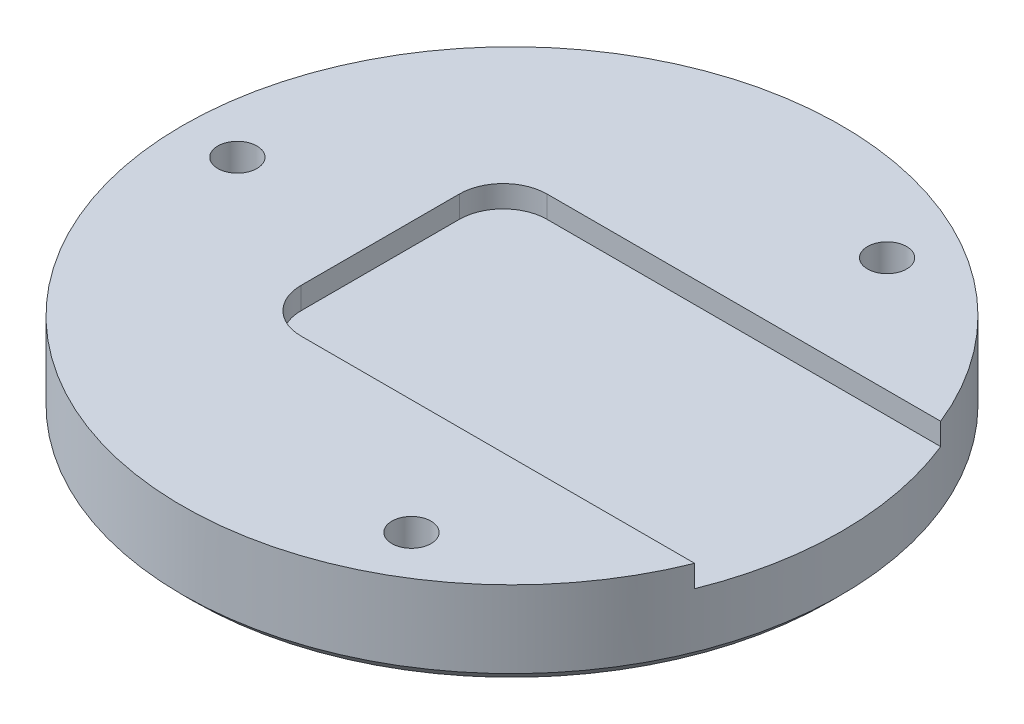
ISO-10303-21;
HEADER;
FILE_DESCRIPTION(('STEP AP214'),'2;1');
FILE_NAME('part.step','',(''),(''),'','','');
FILE_SCHEMA(('AUTOMOTIVE_DESIGN { 1 0 10303 214 1 1 1 1 }'));
ENDSEC;
DATA;
#1=APPLICATION_CONTEXT('core data for automotive mechanical design processes');
#2=APPLICATION_PROTOCOL_DEFINITION('international standard','automotive_design',2000,#1);
#3=PRODUCT_CONTEXT('',#1,'mechanical');
#4=PRODUCT('Part','Part','',(#3));
#5=PRODUCT_RELATED_PRODUCT_CATEGORY('part','',(#4));
#6=PRODUCT_DEFINITION_FORMATION('','',#4);
#7=PRODUCT_DEFINITION_CONTEXT('part definition',#1,'design');
#8=PRODUCT_DEFINITION('design','',#6,#7);
#9=PRODUCT_DEFINITION_SHAPE('','',#8);
#10=(LENGTH_UNIT() NAMED_UNIT(*) SI_UNIT(.MILLI.,.METRE.));
#11=(NAMED_UNIT(*) PLANE_ANGLE_UNIT() SI_UNIT($,.RADIAN.));
#12=(NAMED_UNIT(*) SI_UNIT($,.STERADIAN.) SOLID_ANGLE_UNIT());
#13=UNCERTAINTY_MEASURE_WITH_UNIT(LENGTH_MEASURE(1.E-05),#10,'distance_accuracy_value','');
#14=(GEOMETRIC_REPRESENTATION_CONTEXT(3) GLOBAL_UNCERTAINTY_ASSIGNED_CONTEXT((#13)) GLOBAL_UNIT_ASSIGNED_CONTEXT((#10,
#11,#12)) REPRESENTATION_CONTEXT('',''));
#15=CARTESIAN_POINT('',(0.,0.,0.));
#16=DIRECTION('',(0.,0.,1.));
#17=DIRECTION('',(1.,0.,0.));
#18=AXIS2_PLACEMENT_3D('',#15,#16,#17);
#19=CARTESIAN_POINT('',(48.1759321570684,-79.2351408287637,64.1677762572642));
#20=DIRECTION('',(0.,-1.,0.));
#21=DIRECTION('',(0.,0.,-1.));
#22=AXIS2_PLACEMENT_3D('',#19,#20,#21);
#23=CYLINDRICAL_SURFACE('',#22,19.05);
#24=CARTESIAN_POINT('',(48.1759321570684,-83.6801408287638,64.1677762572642));
#25=DIRECTION('',(0.,1.,0.));
#26=DIRECTION('',(0.,0.,1.));
#27=AXIS2_PLACEMENT_3D('',#24,#25,#26);
#28=CIRCLE('',#27,19.05);
#29=CARTESIAN_POINT('',(48.1759321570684,-83.6801408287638,83.2177762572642));
#30=VERTEX_POINT('',#29);
#31=EDGE_CURVE('E52',#30,#30,#28,.T.);
#32=ORIENTED_EDGE('',*,*,#31,.T.);
#33=EDGE_LOOP('',(#32));
#34=FACE_BOUND('',#33,.T.);
#35=CARTESIAN_POINT('',(48.1759321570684,-79.2351408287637,64.1677762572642));
#36=DIRECTION('',(0.,1.,0.));
#37=DIRECTION('',(0.,0.,1.));
#38=AXIS2_PLACEMENT_3D('',#35,#36,#37);
#39=CIRCLE('',#38,19.05);
#40=CARTESIAN_POINT('',(65.8485651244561,-79.2351408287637,57.0557762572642));
#41=VERTEX_POINT('',#40);
#42=CARTESIAN_POINT('',(65.8485651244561,-79.2351408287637,71.2797762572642));
#43=VERTEX_POINT('',#42);
#44=EDGE_CURVE('E124',#41,#43,#39,.T.);
#45=ORIENTED_EDGE('',*,*,#44,.F.);
#46=DIRECTION('',(0.,1.,0.));
#47=VECTOR('',#46,1.);
#48=CARTESIAN_POINT('',(65.8485651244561,-80.5051408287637,57.0557762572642));
#49=LINE('',#48,#47);
#50=CARTESIAN_POINT('',(65.8485651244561,-80.5051408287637,57.0557762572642));
#51=VERTEX_POINT('',#50);
#52=EDGE_CURVE('E104',#51,#41,#49,.T.);
#53=ORIENTED_EDGE('',*,*,#52,.F.);
#54=CARTESIAN_POINT('',(48.1759321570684,-80.5051408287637,64.1677762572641));
#55=DIRECTION('',(0.,1.,0.));
#56=DIRECTION('',(0.,0.,1.));
#57=AXIS2_PLACEMENT_3D('',#54,#55,#56);
#58=CIRCLE('',#57,19.05);
#59=CARTESIAN_POINT('',(65.8485651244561,-80.5051408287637,71.2797762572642));
#60=VERTEX_POINT('',#59);
#61=EDGE_CURVE('E110',#60,#51,#58,.T.);
#62=ORIENTED_EDGE('',*,*,#61,.F.);
#63=DIRECTION('',(0.,1.,0.));
#64=VECTOR('',#63,1.);
#65=CARTESIAN_POINT('',(65.8485651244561,-80.5051408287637,71.2797762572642));
#66=LINE('',#65,#64);
#67=EDGE_CURVE('E125',#60,#43,#66,.T.);
#68=ORIENTED_EDGE('',*,*,#67,.T.);
#69=EDGE_LOOP('',(#45,#53,#62,#68));
#70=FACE_BOUND('',#69,.T.);
#71=ADVANCED_FACE('F43',(#34,#70),#23,.T.);
#72=CARTESIAN_POINT('',(48.1759321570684,-79.2351408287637,64.1677762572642));
#73=DIRECTION('',(0.,1.,0.));
#74=DIRECTION('',(0.,0.,1.));
#75=AXIS2_PLACEMENT_3D('',#72,#73,#74);
#76=PLANE('',#75);
#77=CARTESIAN_POINT('',(56.1134321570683,-79.2351408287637,50.4196229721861));
#78=DIRECTION('',(0.,1.,0.));
#79=DIRECTION('',(0.,0.,1.));
#80=AXIS2_PLACEMENT_3D('',#77,#78,#79);
#81=CIRCLE('',#80,1.1303);
#82=CARTESIAN_POINT('',(56.1134321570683,-79.2351408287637,51.5499229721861));
#83=VERTEX_POINT('',#82);
#84=EDGE_CURVE('E199',#83,#83,#81,.T.);
#85=ORIENTED_EDGE('',*,*,#84,.F.);
#86=EDGE_LOOP('',(#85));
#87=FACE_BOUND('',#86,.T.);
#88=CARTESIAN_POINT('',(56.1134321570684,-79.2351408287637,77.9159295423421));
#89=DIRECTION('',(0.,1.,0.));
#90=DIRECTION('',(0.,0.,1.));
#91=AXIS2_PLACEMENT_3D('',#88,#89,#90);
#92=CIRCLE('',#91,1.1303);
#93=CARTESIAN_POINT('',(56.1134321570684,-79.2351408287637,79.0462295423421));
#94=VERTEX_POINT('',#93);
#95=EDGE_CURVE('E192',#94,#94,#92,.T.);
#96=ORIENTED_EDGE('',*,*,#95,.F.);
#97=EDGE_LOOP('',(#96));
#98=FACE_BOUND('',#97,.T.);
#99=CARTESIAN_POINT('',(32.3009321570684,-79.2351408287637,64.1677762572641));
#100=DIRECTION('',(0.,1.,0.));
#101=DIRECTION('',(0.,0.,1.));
#102=AXIS2_PLACEMENT_3D('',#99,#100,#101);
#103=CIRCLE('',#102,1.1303);
#104=CARTESIAN_POINT('',(32.3009321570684,-79.2351408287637,65.2980762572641));
#105=VERTEX_POINT('',#104);
#106=EDGE_CURVE('E196',#105,#105,#103,.T.);
#107=ORIENTED_EDGE('',*,*,#106,.F.);
#108=EDGE_LOOP('',(#107));
#109=FACE_BOUND('',#108,.T.);
#110=DIRECTION('',(-1.,0.,0.));
#111=VECTOR('',#110,1.);
#112=CARTESIAN_POINT('',(48.1759321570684,-79.2351408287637,57.0557762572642));
#113=LINE('',#112,#111);
#114=CARTESIAN_POINT('',(43.0959321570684,-79.2351408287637,57.0557762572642));
#115=VERTEX_POINT('',#114);
#116=EDGE_CURVE('E221',#41,#115,#113,.T.);
#117=ORIENTED_EDGE('',*,*,#116,.F.);
#118=ORIENTED_EDGE('',*,*,#44,.T.);
#119=DIRECTION('',(1.,0.,0.));
#120=VECTOR('',#119,1.);
#121=CARTESIAN_POINT('',(48.1759321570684,-79.2351408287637,71.2797762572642));
#122=LINE('',#121,#120);
#123=CARTESIAN_POINT('',(43.0959321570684,-79.2351408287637,71.2797762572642));
#124=VERTEX_POINT('',#123);
#125=EDGE_CURVE('E219',#124,#43,#122,.T.);
#126=ORIENTED_EDGE('',*,*,#125,.F.);
#127=CARTESIAN_POINT('',(43.0959321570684,-79.2351408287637,68.7397762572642));
#128=DIRECTION('',(0.,1.,0.));
#129=DIRECTION('',(0.,0.,1.));
#130=AXIS2_PLACEMENT_3D('',#127,#128,#129);
#131=CIRCLE('',#130,2.54);
#132=CARTESIAN_POINT('',(40.5559321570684,-79.2351408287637,68.7397762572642));
#133=VERTEX_POINT('',#132);
#134=EDGE_CURVE('E216',#133,#124,#131,.T.);
#135=ORIENTED_EDGE('',*,*,#134,.F.);
#136=DIRECTION('',(0.,0.,1.));
#137=VECTOR('',#136,1.);
#138=CARTESIAN_POINT('',(40.5559321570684,-79.2351408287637,64.1677762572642));
#139=LINE('',#138,#137);
#140=CARTESIAN_POINT('',(40.5559321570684,-79.2351408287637,59.5957762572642));
#141=VERTEX_POINT('',#140);
#142=EDGE_CURVE('E59',#141,#133,#139,.T.);
#143=ORIENTED_EDGE('',*,*,#142,.F.);
#144=CARTESIAN_POINT('',(43.0959321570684,-79.2351408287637,59.5957762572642));
#145=DIRECTION('',(0.,1.,0.));
#146=DIRECTION('',(0.,0.,1.));
#147=AXIS2_PLACEMENT_3D('',#144,#145,#146);
#148=CIRCLE('',#147,2.54);
#149=EDGE_CURVE('E211',#115,#141,#148,.T.);
#150=ORIENTED_EDGE('',*,*,#149,.F.);
#151=EDGE_LOOP('',(#117,#118,#126,#135,#143,#150));
#152=FACE_BOUND('',#151,.T.);
#153=ADVANCED_FACE('F149',(#87,#98,#109,#152),#76,.T.);
#154=CARTESIAN_POINT('',(48.1759321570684,-84.3151408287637,64.1677762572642));
#155=DIRECTION('',(0.,1.,0.));
#156=DIRECTION('',(0.,0.,1.));
#157=AXIS2_PLACEMENT_3D('',#154,#155,#156);
#158=PLANE('',#157);
#159=CARTESIAN_POINT('',(48.1759321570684,-84.3151408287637,64.1677762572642));
#160=DIRECTION('',(0.,1.,0.));
#161=DIRECTION('',(0.,0.,1.));
#162=AXIS2_PLACEMENT_3D('',#159,#160,#161);
#163=CIRCLE('',#162,18.415);
#164=CARTESIAN_POINT('',(48.1759321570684,-84.3151408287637,82.5827762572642));
#165=VERTEX_POINT('',#164);
#166=EDGE_CURVE('E11',#165,#165,#163,.F.);
#167=ORIENTED_EDGE('',*,*,#166,.T.);
#168=EDGE_LOOP('',(#167));
#169=FACE_BOUND('',#168,.T.);
#170=CARTESIAN_POINT('',(56.1134321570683,-84.3151408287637,50.4196229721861));
#171=DIRECTION('',(0.,1.,0.));
#172=DIRECTION('',(0.,0.,1.));
#173=AXIS2_PLACEMENT_3D('',#170,#171,#172);
#174=CIRCLE('',#173,1.1303);
#175=CARTESIAN_POINT('',(56.1134321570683,-84.3151408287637,51.5499229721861));
#176=VERTEX_POINT('',#175);
#177=EDGE_CURVE('E194',#176,#176,#174,.T.);
#178=ORIENTED_EDGE('',*,*,#177,.T.);
#179=EDGE_LOOP('',(#178));
#180=FACE_BOUND('',#179,.T.);
#181=CARTESIAN_POINT('',(56.1134321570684,-84.3151408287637,77.9159295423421));
#182=DIRECTION('',(0.,1.,0.));
#183=DIRECTION('',(0.,0.,1.));
#184=AXIS2_PLACEMENT_3D('',#181,#182,#183);
#185=CIRCLE('',#184,1.1303);
#186=CARTESIAN_POINT('',(56.1134321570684,-84.3151408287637,79.0462295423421));
#187=VERTEX_POINT('',#186);
#188=EDGE_CURVE('E189',#187,#187,#185,.T.);
#189=ORIENTED_EDGE('',*,*,#188,.T.);
#190=EDGE_LOOP('',(#189));
#191=FACE_BOUND('',#190,.T.);
#192=CARTESIAN_POINT('',(32.3009321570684,-84.3151408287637,64.1677762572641));
#193=DIRECTION('',(0.,1.,0.));
#194=DIRECTION('',(0.,0.,1.));
#195=AXIS2_PLACEMENT_3D('',#192,#193,#194);
#196=CIRCLE('',#195,1.1303);
#197=CARTESIAN_POINT('',(32.3009321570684,-84.3151408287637,65.2980762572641));
#198=VERTEX_POINT('',#197);
#199=EDGE_CURVE('E205',#198,#198,#196,.T.);
#200=ORIENTED_EDGE('',*,*,#199,.T.);
#201=EDGE_LOOP('',(#200));
#202=FACE_BOUND('',#201,.T.);
#203=ADVANCED_FACE('F153',(#169,#180,#191,#202),#158,.F.);
#204=CARTESIAN_POINT('',(40.5559321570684,-80.5051408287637,64.1677762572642));
#205=DIRECTION('',(-1.,0.,0.));
#206=DIRECTION('',(0.,0.,1.));
#207=AXIS2_PLACEMENT_3D('',#204,#205,#206);
#208=PLANE('',#207);
#209=ORIENTED_EDGE('',*,*,#142,.T.);
#210=DIRECTION('',(0.,1.,0.));
#211=VECTOR('',#210,1.);
#212=CARTESIAN_POINT('',(40.5559321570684,-80.5051408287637,68.7397762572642));
#213=LINE('',#212,#211);
#214=CARTESIAN_POINT('',(40.5559321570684,-80.5051408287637,68.7397762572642));
#215=VERTEX_POINT('',#214);
#216=EDGE_CURVE('E89',#215,#133,#213,.T.);
#217=ORIENTED_EDGE('',*,*,#216,.F.);
#218=DIRECTION('',(0.,0.,1.));
#219=VECTOR('',#218,1.);
#220=CARTESIAN_POINT('',(40.5559321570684,-80.5051408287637,64.1677762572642));
#221=LINE('',#220,#219);
#222=CARTESIAN_POINT('',(40.5559321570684,-80.5051408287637,59.5957762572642));
#223=VERTEX_POINT('',#222);
#224=EDGE_CURVE('E208',#223,#215,#221,.T.);
#225=ORIENTED_EDGE('',*,*,#224,.F.);
#226=DIRECTION('',(0.,1.,0.));
#227=VECTOR('',#226,1.);
#228=CARTESIAN_POINT('',(40.5559321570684,-80.5051408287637,59.5957762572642));
#229=LINE('',#228,#227);
#230=EDGE_CURVE('E67',#223,#141,#229,.T.);
#231=ORIENTED_EDGE('',*,*,#230,.T.);
#232=EDGE_LOOP('',(#209,#217,#225,#231));
#233=FACE_BOUND('',#232,.T.);
#234=ADVANCED_FACE('F158',(#233),#208,.F.);
#235=CARTESIAN_POINT('',(43.0959321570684,-80.5051408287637,59.5957762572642));
#236=DIRECTION('',(0.,1.,0.));
#237=DIRECTION('',(0.,0.,1.));
#238=AXIS2_PLACEMENT_3D('',#235,#236,#237);
#239=CYLINDRICAL_SURFACE('',#238,2.54);
#240=ORIENTED_EDGE('',*,*,#149,.T.);
#241=ORIENTED_EDGE('',*,*,#230,.F.);
#242=CARTESIAN_POINT('',(43.0959321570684,-80.5051408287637,59.5957762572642));
#243=DIRECTION('',(0.,1.,0.));
#244=DIRECTION('',(0.,0.,1.));
#245=AXIS2_PLACEMENT_3D('',#242,#243,#244);
#246=CIRCLE('',#245,2.54);
#247=CARTESIAN_POINT('',(43.0959321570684,-80.5051408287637,57.0557762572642));
#248=VERTEX_POINT('',#247);
#249=EDGE_CURVE('E109',#248,#223,#246,.T.);
#250=ORIENTED_EDGE('',*,*,#249,.F.);
#251=DIRECTION('',(0.,1.,0.));
#252=VECTOR('',#251,1.);
#253=CARTESIAN_POINT('',(43.0959321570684,-80.5051408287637,57.0557762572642));
#254=LINE('',#253,#252);
#255=EDGE_CURVE('E106',#248,#115,#254,.T.);
#256=ORIENTED_EDGE('',*,*,#255,.T.);
#257=EDGE_LOOP('',(#240,#241,#250,#256));
#258=FACE_BOUND('',#257,.T.);
#259=ADVANCED_FACE('F163',(#258),#239,.F.);
#260=CARTESIAN_POINT('',(48.1759321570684,-80.5051408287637,57.0557762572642));
#261=DIRECTION('',(0.,0.,-1.));
#262=DIRECTION('',(-1.,0.,0.));
#263=AXIS2_PLACEMENT_3D('',#260,#261,#262);
#264=PLANE('',#263);
#265=ORIENTED_EDGE('',*,*,#116,.T.);
#266=ORIENTED_EDGE('',*,*,#255,.F.);
#267=DIRECTION('',(-1.,0.,0.));
#268=VECTOR('',#267,1.);
#269=CARTESIAN_POINT('',(48.1759321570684,-80.5051408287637,57.0557762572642));
#270=LINE('',#269,#268);
#271=EDGE_CURVE('E99',#51,#248,#270,.T.);
#272=ORIENTED_EDGE('',*,*,#271,.F.);
#273=ORIENTED_EDGE('',*,*,#52,.T.);
#274=EDGE_LOOP('',(#265,#266,#272,#273));
#275=FACE_BOUND('',#274,.T.);
#276=ADVANCED_FACE('F102',(#275),#264,.F.);
#277=CARTESIAN_POINT('',(48.1759321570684,-80.5051408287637,71.2797762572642));
#278=DIRECTION('',(0.,0.,1.));
#279=DIRECTION('',(1.,0.,0.));
#280=AXIS2_PLACEMENT_3D('',#277,#278,#279);
#281=PLANE('',#280);
#282=ORIENTED_EDGE('',*,*,#125,.T.);
#283=ORIENTED_EDGE('',*,*,#67,.F.);
#284=DIRECTION('',(1.,0.,0.));
#285=VECTOR('',#284,1.);
#286=CARTESIAN_POINT('',(48.1759321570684,-80.5051408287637,71.2797762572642));
#287=LINE('',#286,#285);
#288=CARTESIAN_POINT('',(43.0959321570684,-80.5051408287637,71.2797762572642));
#289=VERTEX_POINT('',#288);
#290=EDGE_CURVE('E118',#289,#60,#287,.T.);
#291=ORIENTED_EDGE('',*,*,#290,.F.);
#292=DIRECTION('',(0.,1.,0.));
#293=VECTOR('',#292,1.);
#294=CARTESIAN_POINT('',(43.0959321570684,-80.5051408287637,71.2797762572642));
#295=LINE('',#294,#293);
#296=EDGE_CURVE('E128',#289,#124,#295,.T.);
#297=ORIENTED_EDGE('',*,*,#296,.T.);
#298=EDGE_LOOP('',(#282,#283,#291,#297));
#299=FACE_BOUND('',#298,.T.);
#300=ADVANCED_FACE('F167',(#299),#281,.F.);
#301=CARTESIAN_POINT('',(43.0959321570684,-80.5051408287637,68.7397762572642));
#302=DIRECTION('',(0.,1.,0.));
#303=DIRECTION('',(0.,0.,1.));
#304=AXIS2_PLACEMENT_3D('',#301,#302,#303);
#305=CYLINDRICAL_SURFACE('',#304,2.54);
#306=ORIENTED_EDGE('',*,*,#134,.T.);
#307=ORIENTED_EDGE('',*,*,#296,.F.);
#308=CARTESIAN_POINT('',(43.0959321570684,-80.5051408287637,68.7397762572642));
#309=DIRECTION('',(0.,1.,0.));
#310=DIRECTION('',(0.,0.,1.));
#311=AXIS2_PLACEMENT_3D('',#308,#309,#310);
#312=CIRCLE('',#311,2.54);
#313=EDGE_CURVE('E210',#215,#289,#312,.T.);
#314=ORIENTED_EDGE('',*,*,#313,.F.);
#315=ORIENTED_EDGE('',*,*,#216,.T.);
#316=EDGE_LOOP('',(#306,#307,#314,#315));
#317=FACE_BOUND('',#316,.T.);
#318=ADVANCED_FACE('F164',(#317),#305,.F.);
#319=CARTESIAN_POINT('',(43.0959321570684,-80.5051408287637,68.7397762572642));
#320=DIRECTION('',(0.,1.,0.));
#321=DIRECTION('',(0.,0.,1.));
#322=AXIS2_PLACEMENT_3D('',#319,#320,#321);
#323=PLANE('',#322);
#324=ORIENTED_EDGE('',*,*,#224,.T.);
#325=ORIENTED_EDGE('',*,*,#313,.T.);
#326=ORIENTED_EDGE('',*,*,#290,.T.);
#327=ORIENTED_EDGE('',*,*,#61,.T.);
#328=ORIENTED_EDGE('',*,*,#271,.T.);
#329=ORIENTED_EDGE('',*,*,#249,.T.);
#330=EDGE_LOOP('',(#324,#325,#326,#327,#328,#329));
#331=FACE_BOUND('',#330,.T.);
#332=ADVANCED_FACE('F115',(#331),#323,.T.);
#333=CARTESIAN_POINT('',(32.3009321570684,-79.2351408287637,64.1677762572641));
#334=DIRECTION('',(0.,1.,0.));
#335=DIRECTION('',(0.,0.,1.));
#336=AXIS2_PLACEMENT_3D('',#333,#334,#335);
#337=CYLINDRICAL_SURFACE('',#336,1.1303);
#338=ORIENTED_EDGE('',*,*,#199,.F.);
#339=EDGE_LOOP('',(#338));
#340=FACE_BOUND('',#339,.T.);
#341=ORIENTED_EDGE('',*,*,#106,.T.);
#342=EDGE_LOOP('',(#341));
#343=FACE_BOUND('',#342,.T.);
#344=ADVANCED_FACE('F178',(#340,#343),#337,.F.);
#345=CARTESIAN_POINT('',(56.1134321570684,-79.2351408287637,77.9159295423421));
#346=DIRECTION('',(0.,1.,0.));
#347=DIRECTION('',(0.,0.,1.));
#348=AXIS2_PLACEMENT_3D('',#345,#346,#347);
#349=CYLINDRICAL_SURFACE('',#348,1.1303);
#350=ORIENTED_EDGE('',*,*,#188,.F.);
#351=EDGE_LOOP('',(#350));
#352=FACE_BOUND('',#351,.T.);
#353=ORIENTED_EDGE('',*,*,#95,.T.);
#354=EDGE_LOOP('',(#353));
#355=FACE_BOUND('',#354,.T.);
#356=ADVANCED_FACE('F144',(#352,#355),#349,.F.);
#357=CARTESIAN_POINT('',(56.1134321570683,-79.2351408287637,50.4196229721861));
#358=DIRECTION('',(0.,1.,0.));
#359=DIRECTION('',(0.,0.,1.));
#360=AXIS2_PLACEMENT_3D('',#357,#358,#359);
#361=CYLINDRICAL_SURFACE('',#360,1.1303);
#362=ORIENTED_EDGE('',*,*,#177,.F.);
#363=EDGE_LOOP('',(#362));
#364=FACE_BOUND('',#363,.T.);
#365=ORIENTED_EDGE('',*,*,#84,.T.);
#366=EDGE_LOOP('',(#365));
#367=FACE_BOUND('',#366,.T.);
#368=ADVANCED_FACE('F139',(#364,#367),#361,.F.);
#369=CARTESIAN_POINT('',(48.1759321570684,-83.6801408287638,64.1677762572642));
#370=DIRECTION('',(0.,1.,0.));
#371=DIRECTION('',(0.,0.,1.));
#372=AXIS2_PLACEMENT_3D('',#369,#370,#371);
#373=CONICAL_SURFACE('',#372,19.05,0.78539816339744);
#374=ORIENTED_EDGE('',*,*,#166,.F.);
#375=EDGE_LOOP('',(#374));
#376=FACE_BOUND('',#375,.T.);
#377=ORIENTED_EDGE('',*,*,#31,.F.);
#378=EDGE_LOOP('',(#377));
#379=FACE_BOUND('',#378,.T.);
#380=ADVANCED_FACE('F46',(#376,#379),#373,.T.);
#381=CLOSED_SHELL('',(#71,#153,#203,#234,#259,#276,#300,#318,#332,#344,#356,#368,#380));
#382=MANIFOLD_SOLID_BREP('B2',#381);
#383=ADVANCED_BREP_SHAPE_REPRESENTATION('',(#18,#382),#14);
#384=SHAPE_DEFINITION_REPRESENTATION(#9,#383);
ENDSEC;
END-ISO-10303-21;
